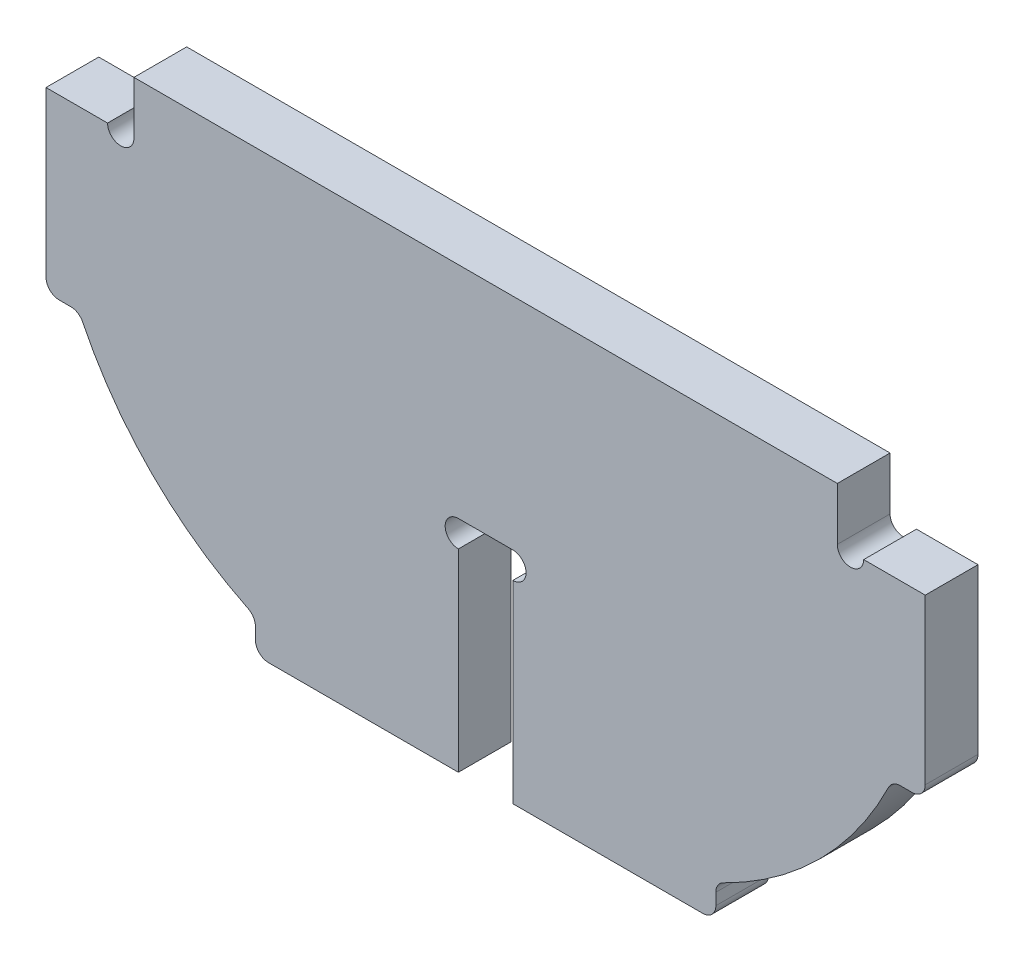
ISO-10303-21;
HEADER;
FILE_DESCRIPTION(('STEP AP214'),'2;1');
FILE_NAME('part.step','',(''),(''),'','','');
FILE_SCHEMA(('AUTOMOTIVE_DESIGN { 1 0 10303 214 1 1 1 1 }'));
ENDSEC;
DATA;
#1=APPLICATION_CONTEXT('core data for automotive mechanical design processes');
#2=APPLICATION_PROTOCOL_DEFINITION('international standard','automotive_design',2000,#1);
#3=PRODUCT_CONTEXT('',#1,'mechanical');
#4=PRODUCT('Part','Part','',(#3));
#5=PRODUCT_RELATED_PRODUCT_CATEGORY('part','',(#4));
#6=PRODUCT_DEFINITION_FORMATION('','',#4);
#7=PRODUCT_DEFINITION_CONTEXT('part definition',#1,'design');
#8=PRODUCT_DEFINITION('design','',#6,#7);
#9=PRODUCT_DEFINITION_SHAPE('','',#8);
#10=(LENGTH_UNIT() NAMED_UNIT(*) SI_UNIT(.MILLI.,.METRE.));
#11=(NAMED_UNIT(*) PLANE_ANGLE_UNIT() SI_UNIT($,.RADIAN.));
#12=(NAMED_UNIT(*) SI_UNIT($,.STERADIAN.) SOLID_ANGLE_UNIT());
#13=UNCERTAINTY_MEASURE_WITH_UNIT(LENGTH_MEASURE(1.E-05),#10,'distance_accuracy_value','');
#14=(GEOMETRIC_REPRESENTATION_CONTEXT(3) GLOBAL_UNCERTAINTY_ASSIGNED_CONTEXT((#13)) GLOBAL_UNIT_ASSIGNED_CONTEXT((#10,
#11,#12)) REPRESENTATION_CONTEXT('',''));
#15=CARTESIAN_POINT('',(0.,0.,0.));
#16=DIRECTION('',(0.,0.,1.));
#17=DIRECTION('',(1.,0.,0.));
#18=AXIS2_PLACEMENT_3D('',#15,#16,#17);
#19=CARTESIAN_POINT('',(-100.,-50.,12.));
#20=DIRECTION('',(0.,1.,0.));
#21=DIRECTION('',(0.,0.,1.));
#22=AXIS2_PLACEMENT_3D('',#19,#20,#21);
#23=PLANE('',#22);
#24=DIRECTION('',(0.,0.,-1.));
#25=VECTOR('',#24,1.);
#26=CARTESIAN_POINT('',(-49.3687742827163,-50.,12.));
#27=LINE('',#26,#25);
#28=CARTESIAN_POINT('',(-49.3687742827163,-50.,12.));
#29=VERTEX_POINT('',#28);
#30=CARTESIAN_POINT('',(-49.3687742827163,-50.,0.));
#31=VERTEX_POINT('',#30);
#32=EDGE_CURVE('E291',#29,#31,#27,.T.);
#33=ORIENTED_EDGE('',*,*,#32,.T.);
#34=DIRECTION('',(1.,0.,0.));
#35=VECTOR('',#34,1.);
#36=CARTESIAN_POINT('',(-100.,-50.,0.));
#37=LINE('',#36,#35);
#38=CARTESIAN_POINT('',(-6.19999999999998,-50.,0.));
#39=VERTEX_POINT('',#38);
#40=EDGE_CURVE('E393',#31,#39,#37,.T.);
#41=ORIENTED_EDGE('',*,*,#40,.T.);
#42=DIRECTION('',(0.,0.,-1.));
#43=VECTOR('',#42,1.);
#44=CARTESIAN_POINT('',(-6.19999999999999,-50.,12.));
#45=LINE('',#44,#43);
#46=CARTESIAN_POINT('',(-6.19999999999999,-50.,12.));
#47=VERTEX_POINT('',#46);
#48=EDGE_CURVE('E377',#47,#39,#45,.T.);
#49=ORIENTED_EDGE('',*,*,#48,.F.);
#50=DIRECTION('',(1.,0.,0.));
#51=VECTOR('',#50,1.);
#52=CARTESIAN_POINT('',(-100.,-50.,12.));
#53=LINE('',#52,#51);
#54=EDGE_CURVE('E411',#29,#47,#53,.T.);
#55=ORIENTED_EDGE('',*,*,#54,.F.);
#56=EDGE_LOOP('',(#33,#41,#49,#55));
#57=FACE_BOUND('',#56,.T.);
#58=ADVANCED_FACE('F35',(#57),#23,.F.);
#59=DIRECTION('',(0.,0.,-1.));
#60=VECTOR('',#59,1.);
#61=CARTESIAN_POINT('',(49.3687742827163,-50.,12.));
#62=LINE('',#61,#60);
#63=CARTESIAN_POINT('',(49.3687742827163,-50.,12.));
#64=VERTEX_POINT('',#63);
#65=CARTESIAN_POINT('',(49.3687742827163,-50.,0.));
#66=VERTEX_POINT('',#65);
#67=EDGE_CURVE('E339',#64,#66,#62,.T.);
#68=ORIENTED_EDGE('',*,*,#67,.F.);
#69=CARTESIAN_POINT('',(6.19999999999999,-50.,12.));
#70=VERTEX_POINT('',#69);
#71=EDGE_CURVE('E410',#70,#64,#53,.T.);
#72=ORIENTED_EDGE('',*,*,#71,.F.);
#73=DIRECTION('',(0.,0.,-1.));
#74=VECTOR('',#73,1.);
#75=CARTESIAN_POINT('',(6.19999999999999,-50.,12.));
#76=LINE('',#75,#74);
#77=CARTESIAN_POINT('',(6.19999999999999,-50.,0.));
#78=VERTEX_POINT('',#77);
#79=EDGE_CURVE('E361',#70,#78,#76,.T.);
#80=ORIENTED_EDGE('',*,*,#79,.T.);
#81=EDGE_CURVE('E432',#78,#66,#37,.T.);
#82=ORIENTED_EDGE('',*,*,#81,.T.);
#83=EDGE_LOOP('',(#68,#72,#80,#82));
#84=FACE_BOUND('',#83,.T.);
#85=ADVANCED_FACE('F515',(#84),#23,.F.);
#86=CARTESIAN_POINT('',(-83.,38.,12.));
#87=DIRECTION('',(0.,0.,1.));
#88=DIRECTION('',(1.,0.,0.));
#89=AXIS2_PLACEMENT_3D('',#86,#87,#88);
#90=PLANE('',#89);
#91=CARTESIAN_POINT('',(-97.,0.631225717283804,12.));
#92=DIRECTION('',(0.,0.,1.));
#93=DIRECTION('',(-1.,0.,0.));
#94=AXIS2_PLACEMENT_3D('',#91,#92,#93);
#95=CIRCLE('',#94,3.);
#96=CARTESIAN_POINT('',(-100.,0.631225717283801,12.));
#97=VERTEX_POINT('',#96);
#98=CARTESIAN_POINT('',(-97.,-2.3687742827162,12.));
#99=VERTEX_POINT('',#98);
#100=EDGE_CURVE('E50',#97,#99,#95,.T.);
#101=ORIENTED_EDGE('',*,*,#100,.T.);
#102=DIRECTION('',(1.,0.,0.));
#103=VECTOR('',#102,1.);
#104=CARTESIAN_POINT('',(-97.,-2.3687742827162,12.));
#105=LINE('',#104,#103);
#106=CARTESIAN_POINT('',(-94.345102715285,-2.36877428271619,12.));
#107=VERTEX_POINT('',#106);
#108=EDGE_CURVE('E257',#99,#107,#105,.T.);
#109=ORIENTED_EDGE('',*,*,#108,.T.);
#110=CARTESIAN_POINT('',(-94.345102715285,-5.3687742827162,12.));
#111=DIRECTION('',(0.,0.,-1.));
#112=DIRECTION('',(-1.,0.,0.));
#113=AXIS2_PLACEMENT_3D('',#110,#111,#112);
#114=CIRCLE('',#113,3.00000000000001);
#115=CARTESIAN_POINT('',(-91.6505696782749,-4.04987636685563,12.));
#116=VERTEX_POINT('',#115);
#117=EDGE_CURVE('E236',#107,#116,#114,.T.);
#118=ORIENTED_EDGE('',*,*,#117,.T.);
#119=CARTESIAN_POINT('',(-18.,32.,12.));
#120=DIRECTION('',(0.,0.,1.));
#121=DIRECTION('',(-1.,0.,0.));
#122=AXIS2_PLACEMENT_3D('',#119,#120,#121);
#123=CIRCLE('',#122,82.);
#124=CARTESIAN_POINT('',(-54.0498763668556,-41.6505696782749,12.));
#125=VERTEX_POINT('',#124);
#126=EDGE_CURVE('E247',#116,#125,#123,.T.);
#127=ORIENTED_EDGE('',*,*,#126,.T.);
#128=CARTESIAN_POINT('',(-55.3687742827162,-44.345102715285,12.));
#129=DIRECTION('',(0.,0.,-1.));
#130=DIRECTION('',(-1.,0.,0.));
#131=AXIS2_PLACEMENT_3D('',#128,#129,#130);
#132=CIRCLE('',#131,2.99999999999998);
#133=CARTESIAN_POINT('',(-52.3687742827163,-44.345102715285,12.));
#134=VERTEX_POINT('',#133);
#135=EDGE_CURVE('E268',#125,#134,#132,.T.);
#136=ORIENTED_EDGE('',*,*,#135,.T.);
#137=DIRECTION('',(0.,-1.,0.));
#138=VECTOR('',#137,1.);
#139=CARTESIAN_POINT('',(-52.3687742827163,-47.,12.));
#140=LINE('',#139,#138);
#141=CARTESIAN_POINT('',(-52.3687742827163,-47.,12.));
#142=VERTEX_POINT('',#141);
#143=EDGE_CURVE('E265',#134,#142,#140,.T.);
#144=ORIENTED_EDGE('',*,*,#143,.T.);
#145=CARTESIAN_POINT('',(-49.3687742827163,-47.,12.));
#146=DIRECTION('',(0.,0.,1.));
#147=DIRECTION('',(-1.,0.,0.));
#148=AXIS2_PLACEMENT_3D('',#145,#146,#147);
#149=CIRCLE('',#148,3.00000000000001);
#150=EDGE_CURVE('E262',#142,#29,#149,.T.);
#151=ORIENTED_EDGE('',*,*,#150,.T.);
#152=ORIENTED_EDGE('',*,*,#54,.T.);
#153=DIRECTION('',(0.,-1.,0.));
#154=VECTOR('',#153,1.);
#155=CARTESIAN_POINT('',(-6.19999999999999,-50.,12.));
#156=LINE('',#155,#154);
#157=CARTESIAN_POINT('',(-6.2,-6.00000000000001,12.));
#158=VERTEX_POINT('',#157);
#159=EDGE_CURVE('E358',#158,#47,#156,.T.);
#160=ORIENTED_EDGE('',*,*,#159,.F.);
#161=CARTESIAN_POINT('',(-6.2,-3.,12.));
#162=DIRECTION('',(0.,0.,1.));
#163=DIRECTION('',(1.,0.,0.));
#164=AXIS2_PLACEMENT_3D('',#161,#162,#163);
#165=CIRCLE('',#164,3.00000000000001);
#166=CARTESIAN_POINT('',(-6.2,0.,12.));
#167=VERTEX_POINT('',#166);
#168=EDGE_CURVE('E356',#167,#158,#165,.T.);
#169=ORIENTED_EDGE('',*,*,#168,.F.);
#170=DIRECTION('',(-1.,0.,0.));
#171=VECTOR('',#170,1.);
#172=CARTESIAN_POINT('',(6.2,0.,12.));
#173=LINE('',#172,#171);
#174=CARTESIAN_POINT('',(6.2,0.,12.));
#175=VERTEX_POINT('',#174);
#176=EDGE_CURVE('E354',#175,#167,#173,.T.);
#177=ORIENTED_EDGE('',*,*,#176,.F.);
#178=CARTESIAN_POINT('',(6.2,-3.,12.));
#179=DIRECTION('',(0.,0.,1.));
#180=DIRECTION('',(1.,0.,0.));
#181=AXIS2_PLACEMENT_3D('',#178,#179,#180);
#182=CIRCLE('',#181,3.);
#183=CARTESIAN_POINT('',(6.2,-6.00000000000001,12.));
#184=VERTEX_POINT('',#183);
#185=EDGE_CURVE('E351',#184,#175,#182,.T.);
#186=ORIENTED_EDGE('',*,*,#185,.F.);
#187=DIRECTION('',(0.,1.,0.));
#188=VECTOR('',#187,1.);
#189=CARTESIAN_POINT('',(6.19999999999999,-50.,12.));
#190=LINE('',#189,#188);
#191=EDGE_CURVE('E349',#70,#184,#190,.T.);
#192=ORIENTED_EDGE('',*,*,#191,.F.);
#193=ORIENTED_EDGE('',*,*,#71,.T.);
#194=CARTESIAN_POINT('',(49.3687742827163,-47.,12.));
#195=DIRECTION('',(0.,0.,-1.));
#196=DIRECTION('',(1.,0.,0.));
#197=AXIS2_PLACEMENT_3D('',#194,#195,#196);
#198=CIRCLE('',#197,3.00000000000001);
#199=CARTESIAN_POINT('',(52.3687742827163,-47.,12.));
#200=VERTEX_POINT('',#199);
#201=EDGE_CURVE('E306',#200,#64,#198,.T.);
#202=ORIENTED_EDGE('',*,*,#201,.F.);
#203=DIRECTION('',(0.,-1.,0.));
#204=VECTOR('',#203,1.);
#205=CARTESIAN_POINT('',(52.3687742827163,-47.,12.));
#206=LINE('',#205,#204);
#207=CARTESIAN_POINT('',(52.3687742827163,-44.345102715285,12.));
#208=VERTEX_POINT('',#207);
#209=EDGE_CURVE('E304',#208,#200,#206,.T.);
#210=ORIENTED_EDGE('',*,*,#209,.F.);
#211=CARTESIAN_POINT('',(55.3687742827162,-44.345102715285,12.));
#212=DIRECTION('',(0.,0.,1.));
#213=DIRECTION('',(1.,0.,0.));
#214=AXIS2_PLACEMENT_3D('',#211,#212,#213);
#215=CIRCLE('',#214,2.99999999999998);
#216=CARTESIAN_POINT('',(54.0498763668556,-41.6505696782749,12.));
#217=VERTEX_POINT('',#216);
#218=EDGE_CURVE('E301',#217,#208,#215,.T.);
#219=ORIENTED_EDGE('',*,*,#218,.F.);
#220=CARTESIAN_POINT('',(18.,32.,12.));
#221=DIRECTION('',(0.,0.,-1.));
#222=DIRECTION('',(1.,0.,0.));
#223=AXIS2_PLACEMENT_3D('',#220,#221,#222);
#224=CIRCLE('',#223,82.);
#225=CARTESIAN_POINT('',(91.6505696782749,-4.04987636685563,12.));
#226=VERTEX_POINT('',#225);
#227=EDGE_CURVE('E299',#226,#217,#224,.T.);
#228=ORIENTED_EDGE('',*,*,#227,.F.);
#229=CARTESIAN_POINT('',(94.345102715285,-5.3687742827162,12.));
#230=DIRECTION('',(0.,0.,1.));
#231=DIRECTION('',(1.,0.,0.));
#232=AXIS2_PLACEMENT_3D('',#229,#230,#231);
#233=CIRCLE('',#232,3.00000000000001);
#234=CARTESIAN_POINT('',(94.345102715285,-2.36877428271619,12.));
#235=VERTEX_POINT('',#234);
#236=EDGE_CURVE('E312',#235,#226,#233,.T.);
#237=ORIENTED_EDGE('',*,*,#236,.F.);
#238=DIRECTION('',(-1.,0.,0.));
#239=VECTOR('',#238,1.);
#240=CARTESIAN_POINT('',(97.,-2.3687742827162,12.));
#241=LINE('',#240,#239);
#242=CARTESIAN_POINT('',(97.,-2.3687742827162,12.));
#243=VERTEX_POINT('',#242);
#244=EDGE_CURVE('E310',#243,#235,#241,.T.);
#245=ORIENTED_EDGE('',*,*,#244,.F.);
#246=CARTESIAN_POINT('',(97.,0.631225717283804,12.));
#247=DIRECTION('',(0.,0.,-1.));
#248=DIRECTION('',(1.,0.,0.));
#249=AXIS2_PLACEMENT_3D('',#246,#247,#248);
#250=CIRCLE('',#249,3.);
#251=CARTESIAN_POINT('',(100.,0.631225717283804,12.));
#252=VERTEX_POINT('',#251);
#253=EDGE_CURVE('E308',#252,#243,#250,.T.);
#254=ORIENTED_EDGE('',*,*,#253,.F.);
#255=DIRECTION('',(0.,1.,0.));
#256=VECTOR('',#255,1.);
#257=CARTESIAN_POINT('',(100.,38.,12.));
#258=LINE('',#257,#256);
#259=CARTESIAN_POINT('',(100.,38.,12.));
#260=VERTEX_POINT('',#259);
#261=EDGE_CURVE('E390',#252,#260,#258,.T.);
#262=ORIENTED_EDGE('',*,*,#261,.T.);
#263=DIRECTION('',(-1.,0.,0.));
#264=VECTOR('',#263,1.);
#265=CARTESIAN_POINT('',(86.,38.,12.));
#266=LINE('',#265,#264);
#267=CARTESIAN_POINT('',(86.,38.,12.));
#268=VERTEX_POINT('',#267);
#269=EDGE_CURVE('E392',#260,#268,#266,.T.);
#270=ORIENTED_EDGE('',*,*,#269,.T.);
#271=CARTESIAN_POINT('',(83.,38.,12.));
#272=DIRECTION('',(0.,0.,-1.));
#273=DIRECTION('',(1.,0.,0.));
#274=AXIS2_PLACEMENT_3D('',#271,#272,#273);
#275=CIRCLE('',#274,3.);
#276=CARTESIAN_POINT('',(80.,38.,12.));
#277=VERTEX_POINT('',#276);
#278=EDGE_CURVE('E395',#268,#277,#275,.T.);
#279=ORIENTED_EDGE('',*,*,#278,.T.);
#280=DIRECTION('',(0.,1.,0.));
#281=VECTOR('',#280,1.);
#282=CARTESIAN_POINT('',(80.,50.,12.));
#283=LINE('',#282,#281);
#284=CARTESIAN_POINT('',(80.,50.,12.));
#285=VERTEX_POINT('',#284);
#286=EDGE_CURVE('E397',#277,#285,#283,.T.);
#287=ORIENTED_EDGE('',*,*,#286,.T.);
#288=DIRECTION('',(-1.,0.,0.));
#289=VECTOR('',#288,1.);
#290=CARTESIAN_POINT('',(-80.,50.,12.));
#291=LINE('',#290,#289);
#292=CARTESIAN_POINT('',(-80.,50.,12.));
#293=VERTEX_POINT('',#292);
#294=EDGE_CURVE('E399',#285,#293,#291,.T.);
#295=ORIENTED_EDGE('',*,*,#294,.T.);
#296=DIRECTION('',(0.,-1.,0.));
#297=VECTOR('',#296,1.);
#298=CARTESIAN_POINT('',(-80.,38.,12.));
#299=LINE('',#298,#297);
#300=CARTESIAN_POINT('',(-80.,38.,12.));
#301=VERTEX_POINT('',#300);
#302=EDGE_CURVE('E401',#293,#301,#299,.T.);
#303=ORIENTED_EDGE('',*,*,#302,.T.);
#304=CARTESIAN_POINT('',(-83.,38.,12.));
#305=DIRECTION('',(0.,0.,-1.));
#306=DIRECTION('',(1.,0.,0.));
#307=AXIS2_PLACEMENT_3D('',#304,#305,#306);
#308=CIRCLE('',#307,3.);
#309=CARTESIAN_POINT('',(-86.,38.,12.));
#310=VERTEX_POINT('',#309);
#311=EDGE_CURVE('E403',#301,#310,#308,.T.);
#312=ORIENTED_EDGE('',*,*,#311,.T.);
#313=DIRECTION('',(-1.,0.,0.));
#314=VECTOR('',#313,1.);
#315=CARTESIAN_POINT('',(-100.,38.,12.));
#316=LINE('',#315,#314);
#317=CARTESIAN_POINT('',(-100.,38.,12.));
#318=VERTEX_POINT('',#317);
#319=EDGE_CURVE('E405',#310,#318,#316,.T.);
#320=ORIENTED_EDGE('',*,*,#319,.T.);
#321=DIRECTION('',(0.,-1.,0.));
#322=VECTOR('',#321,1.);
#323=CARTESIAN_POINT('',(-100.,38.,12.));
#324=LINE('',#323,#322);
#325=EDGE_CURVE('E407',#318,#97,#324,.T.);
#326=ORIENTED_EDGE('',*,*,#325,.T.);
#327=EDGE_LOOP('',(#101,#109,#118,#127,#136,#144,#151,#152,#160,#169,#177,#186,#192,#193,#202,
#210,#219,#228,#237,#245,#254,#262,#270,#279,#287,#295,#303,#312,#320,#326));
#328=FACE_BOUND('',#327,.T.);
#329=ADVANCED_FACE('F255',(#328),#90,.T.);
#330=CARTESIAN_POINT('',(-83.,38.,0.));
#331=DIRECTION('',(0.,0.,1.));
#332=DIRECTION('',(1.,0.,0.));
#333=AXIS2_PLACEMENT_3D('',#330,#331,#332);
#334=PLANE('',#333);
#335=DIRECTION('',(1.,0.,0.));
#336=VECTOR('',#335,1.);
#337=CARTESIAN_POINT('',(-97.,-2.3687742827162,0.));
#338=LINE('',#337,#336);
#339=CARTESIAN_POINT('',(-97.,-2.3687742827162,0.));
#340=VERTEX_POINT('',#339);
#341=CARTESIAN_POINT('',(-94.345102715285,-2.36877428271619,0.));
#342=VERTEX_POINT('',#341);
#343=EDGE_CURVE('E273',#340,#342,#338,.T.);
#344=ORIENTED_EDGE('',*,*,#343,.F.);
#345=CARTESIAN_POINT('',(-97.,0.631225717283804,0.));
#346=DIRECTION('',(0.,0.,1.));
#347=DIRECTION('',(-1.,0.,0.));
#348=AXIS2_PLACEMENT_3D('',#345,#346,#347);
#349=CIRCLE('',#348,3.);
#350=CARTESIAN_POINT('',(-100.,0.631225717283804,0.));
#351=VERTEX_POINT('',#350);
#352=EDGE_CURVE('E276',#351,#340,#349,.T.);
#353=ORIENTED_EDGE('',*,*,#352,.F.);
#354=DIRECTION('',(0.,-1.,0.));
#355=VECTOR('',#354,1.);
#356=CARTESIAN_POINT('',(-100.,38.,0.));
#357=LINE('',#356,#355);
#358=CARTESIAN_POINT('',(-100.,38.,0.));
#359=VERTEX_POINT('',#358);
#360=EDGE_CURVE('E429',#359,#351,#357,.T.);
#361=ORIENTED_EDGE('',*,*,#360,.F.);
#362=DIRECTION('',(-1.,0.,0.));
#363=VECTOR('',#362,1.);
#364=CARTESIAN_POINT('',(-100.,38.,0.));
#365=LINE('',#364,#363);
#366=CARTESIAN_POINT('',(-86.,38.,0.));
#367=VERTEX_POINT('',#366);
#368=EDGE_CURVE('E427',#367,#359,#365,.T.);
#369=ORIENTED_EDGE('',*,*,#368,.F.);
#370=CARTESIAN_POINT('',(-83.,38.,0.));
#371=DIRECTION('',(0.,0.,-1.));
#372=DIRECTION('',(1.,0.,0.));
#373=AXIS2_PLACEMENT_3D('',#370,#371,#372);
#374=CIRCLE('',#373,3.);
#375=CARTESIAN_POINT('',(-80.,38.,0.));
#376=VERTEX_POINT('',#375);
#377=EDGE_CURVE('E425',#376,#367,#374,.T.);
#378=ORIENTED_EDGE('',*,*,#377,.F.);
#379=DIRECTION('',(0.,-1.,0.));
#380=VECTOR('',#379,1.);
#381=CARTESIAN_POINT('',(-80.,38.,0.));
#382=LINE('',#381,#380);
#383=CARTESIAN_POINT('',(-80.,50.,0.));
#384=VERTEX_POINT('',#383);
#385=EDGE_CURVE('E423',#384,#376,#382,.T.);
#386=ORIENTED_EDGE('',*,*,#385,.F.);
#387=DIRECTION('',(-1.,0.,0.));
#388=VECTOR('',#387,1.);
#389=CARTESIAN_POINT('',(-80.,50.,0.));
#390=LINE('',#389,#388);
#391=CARTESIAN_POINT('',(80.,50.,0.));
#392=VERTEX_POINT('',#391);
#393=EDGE_CURVE('E421',#392,#384,#390,.T.);
#394=ORIENTED_EDGE('',*,*,#393,.F.);
#395=DIRECTION('',(0.,1.,0.));
#396=VECTOR('',#395,1.);
#397=CARTESIAN_POINT('',(80.,50.,0.));
#398=LINE('',#397,#396);
#399=CARTESIAN_POINT('',(80.,38.,0.));
#400=VERTEX_POINT('',#399);
#401=EDGE_CURVE('E419',#400,#392,#398,.T.);
#402=ORIENTED_EDGE('',*,*,#401,.F.);
#403=CARTESIAN_POINT('',(83.,38.,0.));
#404=DIRECTION('',(0.,0.,-1.));
#405=DIRECTION('',(1.,0.,0.));
#406=AXIS2_PLACEMENT_3D('',#403,#404,#405);
#407=CIRCLE('',#406,3.);
#408=CARTESIAN_POINT('',(86.,38.,0.));
#409=VERTEX_POINT('',#408);
#410=EDGE_CURVE('E417',#409,#400,#407,.T.);
#411=ORIENTED_EDGE('',*,*,#410,.F.);
#412=DIRECTION('',(-1.,0.,0.));
#413=VECTOR('',#412,1.);
#414=CARTESIAN_POINT('',(86.,38.,0.));
#415=LINE('',#414,#413);
#416=CARTESIAN_POINT('',(100.,38.,0.));
#417=VERTEX_POINT('',#416);
#418=EDGE_CURVE('E415',#417,#409,#415,.T.);
#419=ORIENTED_EDGE('',*,*,#418,.F.);
#420=DIRECTION('',(0.,1.,0.));
#421=VECTOR('',#420,1.);
#422=CARTESIAN_POINT('',(100.,38.,0.));
#423=LINE('',#422,#421);
#424=CARTESIAN_POINT('',(100.,0.631225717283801,0.));
#425=VERTEX_POINT('',#424);
#426=EDGE_CURVE('E389',#425,#417,#423,.T.);
#427=ORIENTED_EDGE('',*,*,#426,.F.);
#428=CARTESIAN_POINT('',(97.,0.631225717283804,0.));
#429=DIRECTION('',(0.,0.,-1.));
#430=DIRECTION('',(1.,0.,0.));
#431=AXIS2_PLACEMENT_3D('',#428,#429,#430);
#432=CIRCLE('',#431,3.);
#433=CARTESIAN_POINT('',(97.,-2.3687742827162,0.));
#434=VERTEX_POINT('',#433);
#435=EDGE_CURVE('E58',#425,#434,#432,.T.);
#436=ORIENTED_EDGE('',*,*,#435,.T.);
#437=DIRECTION('',(-1.,0.,0.));
#438=VECTOR('',#437,1.);
#439=CARTESIAN_POINT('',(97.,-2.3687742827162,0.));
#440=LINE('',#439,#438);
#441=CARTESIAN_POINT('',(94.345102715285,-2.36877428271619,0.));
#442=VERTEX_POINT('',#441);
#443=EDGE_CURVE('E327',#434,#442,#440,.T.);
#444=ORIENTED_EDGE('',*,*,#443,.T.);
#445=CARTESIAN_POINT('',(94.345102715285,-5.3687742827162,0.));
#446=DIRECTION('',(0.,0.,1.));
#447=DIRECTION('',(1.,0.,0.));
#448=AXIS2_PLACEMENT_3D('',#445,#446,#447);
#449=CIRCLE('',#448,3.00000000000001);
#450=CARTESIAN_POINT('',(91.6505696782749,-4.04987636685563,0.));
#451=VERTEX_POINT('',#450);
#452=EDGE_CURVE('E302',#442,#451,#449,.T.);
#453=ORIENTED_EDGE('',*,*,#452,.T.);
#454=CARTESIAN_POINT('',(18.,32.,0.));
#455=DIRECTION('',(0.,0.,-1.));
#456=DIRECTION('',(1.,0.,0.));
#457=AXIS2_PLACEMENT_3D('',#454,#455,#456);
#458=CIRCLE('',#457,82.);
#459=CARTESIAN_POINT('',(54.0498763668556,-41.6505696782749,0.));
#460=VERTEX_POINT('',#459);
#461=EDGE_CURVE('E243',#451,#460,#458,.T.);
#462=ORIENTED_EDGE('',*,*,#461,.T.);
#463=CARTESIAN_POINT('',(55.3687742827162,-44.345102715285,0.));
#464=DIRECTION('',(0.,0.,1.));
#465=DIRECTION('',(1.,0.,0.));
#466=AXIS2_PLACEMENT_3D('',#463,#464,#465);
#467=CIRCLE('',#466,2.99999999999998);
#468=CARTESIAN_POINT('',(52.3687742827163,-44.345102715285,0.));
#469=VERTEX_POINT('',#468);
#470=EDGE_CURVE('E317',#460,#469,#467,.T.);
#471=ORIENTED_EDGE('',*,*,#470,.T.);
#472=DIRECTION('',(0.,-1.,0.));
#473=VECTOR('',#472,1.);
#474=CARTESIAN_POINT('',(52.3687742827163,-47.,0.));
#475=LINE('',#474,#473);
#476=CARTESIAN_POINT('',(52.3687742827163,-47.,0.));
#477=VERTEX_POINT('',#476);
#478=EDGE_CURVE('E320',#469,#477,#475,.T.);
#479=ORIENTED_EDGE('',*,*,#478,.T.);
#480=CARTESIAN_POINT('',(49.3687742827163,-47.,0.));
#481=DIRECTION('',(0.,0.,-1.));
#482=DIRECTION('',(1.,0.,0.));
#483=AXIS2_PLACEMENT_3D('',#480,#481,#482);
#484=CIRCLE('',#483,3.00000000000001);
#485=EDGE_CURVE('E323',#477,#66,#484,.T.);
#486=ORIENTED_EDGE('',*,*,#485,.T.);
#487=ORIENTED_EDGE('',*,*,#81,.F.);
#488=DIRECTION('',(0.,1.,0.));
#489=VECTOR('',#488,1.);
#490=CARTESIAN_POINT('',(6.19999999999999,-50.,0.));
#491=LINE('',#490,#489);
#492=CARTESIAN_POINT('',(6.2,-6.00000000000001,0.));
#493=VERTEX_POINT('',#492);
#494=EDGE_CURVE('E348',#78,#493,#491,.T.);
#495=ORIENTED_EDGE('',*,*,#494,.T.);
#496=CARTESIAN_POINT('',(6.2,-3.,0.));
#497=DIRECTION('',(0.,0.,1.));
#498=DIRECTION('',(1.,0.,0.));
#499=AXIS2_PLACEMENT_3D('',#496,#497,#498);
#500=CIRCLE('',#499,3.);
#501=CARTESIAN_POINT('',(6.2,0.,0.));
#502=VERTEX_POINT('',#501);
#503=EDGE_CURVE('E364',#493,#502,#500,.T.);
#504=ORIENTED_EDGE('',*,*,#503,.T.);
#505=DIRECTION('',(-1.,0.,0.));
#506=VECTOR('',#505,1.);
#507=CARTESIAN_POINT('',(6.2,0.,0.));
#508=LINE('',#507,#506);
#509=CARTESIAN_POINT('',(-6.2,0.,0.));
#510=VERTEX_POINT('',#509);
#511=EDGE_CURVE('E367',#502,#510,#508,.T.);
#512=ORIENTED_EDGE('',*,*,#511,.T.);
#513=CARTESIAN_POINT('',(-6.2,-3.,0.));
#514=DIRECTION('',(0.,0.,1.));
#515=DIRECTION('',(1.,0.,0.));
#516=AXIS2_PLACEMENT_3D('',#513,#514,#515);
#517=CIRCLE('',#516,3.00000000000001);
#518=CARTESIAN_POINT('',(-6.2,-6.00000000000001,0.));
#519=VERTEX_POINT('',#518);
#520=EDGE_CURVE('E370',#510,#519,#517,.T.);
#521=ORIENTED_EDGE('',*,*,#520,.T.);
#522=DIRECTION('',(0.,-1.,0.));
#523=VECTOR('',#522,1.);
#524=CARTESIAN_POINT('',(-6.19999999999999,-50.,0.));
#525=LINE('',#524,#523);
#526=EDGE_CURVE('E352',#519,#39,#525,.T.);
#527=ORIENTED_EDGE('',*,*,#526,.T.);
#528=ORIENTED_EDGE('',*,*,#40,.F.);
#529=CARTESIAN_POINT('',(-49.3687742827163,-47.,0.));
#530=DIRECTION('',(0.,0.,1.));
#531=DIRECTION('',(-1.,0.,0.));
#532=AXIS2_PLACEMENT_3D('',#529,#530,#531);
#533=CIRCLE('',#532,3.00000000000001);
#534=CARTESIAN_POINT('',(-52.3687742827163,-47.,0.));
#535=VERTEX_POINT('',#534);
#536=EDGE_CURVE('E279',#535,#31,#533,.T.);
#537=ORIENTED_EDGE('',*,*,#536,.F.);
#538=DIRECTION('',(0.,-1.,0.));
#539=VECTOR('',#538,1.);
#540=CARTESIAN_POINT('',(-52.3687742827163,-47.,0.));
#541=LINE('',#540,#539);
#542=CARTESIAN_POINT('',(-52.3687742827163,-44.345102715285,0.));
#543=VERTEX_POINT('',#542);
#544=EDGE_CURVE('E281',#543,#535,#541,.T.);
#545=ORIENTED_EDGE('',*,*,#544,.F.);
#546=CARTESIAN_POINT('',(-55.3687742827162,-44.345102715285,0.));
#547=DIRECTION('',(0.,0.,-1.));
#548=DIRECTION('',(-1.,0.,0.));
#549=AXIS2_PLACEMENT_3D('',#546,#547,#548);
#550=CIRCLE('',#549,2.99999999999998);
#551=CARTESIAN_POINT('',(-54.0498763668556,-41.6505696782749,0.));
#552=VERTEX_POINT('',#551);
#553=EDGE_CURVE('E253',#552,#543,#550,.T.);
#554=ORIENTED_EDGE('',*,*,#553,.F.);
#555=CARTESIAN_POINT('',(-18.,32.,0.));
#556=DIRECTION('',(0.,0.,1.));
#557=DIRECTION('',(-1.,0.,0.));
#558=AXIS2_PLACEMENT_3D('',#555,#556,#557);
#559=CIRCLE('',#558,82.);
#560=CARTESIAN_POINT('',(-91.6505696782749,-4.04987636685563,0.));
#561=VERTEX_POINT('',#560);
#562=EDGE_CURVE('E270',#561,#552,#559,.T.);
#563=ORIENTED_EDGE('',*,*,#562,.F.);
#564=CARTESIAN_POINT('',(-94.345102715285,-5.3687742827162,0.));
#565=DIRECTION('',(0.,0.,-1.));
#566=DIRECTION('',(-1.,0.,0.));
#567=AXIS2_PLACEMENT_3D('',#564,#565,#566);
#568=CIRCLE('',#567,3.00000000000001);
#569=EDGE_CURVE('E239',#342,#561,#568,.T.);
#570=ORIENTED_EDGE('',*,*,#569,.F.);
#571=EDGE_LOOP('',(#344,#353,#361,#369,#378,#386,#394,#402,#411,#419,#427,#436,#444,#453,#462,
#471,#479,#486,#487,#495,#504,#512,#521,#527,#528,#537,#545,#554,#563,#570));
#572=FACE_BOUND('',#571,.T.);
#573=ADVANCED_FACE('F463',(#572),#334,.F.);
#574=CARTESIAN_POINT('',(100.,38.,12.));
#575=DIRECTION('',(-1.,0.,0.));
#576=DIRECTION('',(0.,-1.,0.));
#577=AXIS2_PLACEMENT_3D('',#574,#575,#576);
#578=PLANE('',#577);
#579=ORIENTED_EDGE('',*,*,#261,.F.);
#580=DIRECTION('',(0.,0.,-1.));
#581=VECTOR('',#580,1.);
#582=CARTESIAN_POINT('',(100.,0.631225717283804,12.));
#583=LINE('',#582,#581);
#584=EDGE_CURVE('E337',#252,#425,#583,.T.);
#585=ORIENTED_EDGE('',*,*,#584,.T.);
#586=ORIENTED_EDGE('',*,*,#426,.T.);
#587=DIRECTION('',(0.,0.,-1.));
#588=VECTOR('',#587,1.);
#589=CARTESIAN_POINT('',(100.,38.,12.));
#590=LINE('',#589,#588);
#591=EDGE_CURVE('E11',#260,#417,#590,.T.);
#592=ORIENTED_EDGE('',*,*,#591,.F.);
#593=EDGE_LOOP('',(#579,#585,#586,#592));
#594=FACE_BOUND('',#593,.T.);
#595=ADVANCED_FACE('F37',(#594),#578,.F.);
#596=CARTESIAN_POINT('',(86.,38.,12.));
#597=DIRECTION('',(0.,-1.,0.));
#598=DIRECTION('',(0.,0.,-1.));
#599=AXIS2_PLACEMENT_3D('',#596,#597,#598);
#600=PLANE('',#599);
#601=ORIENTED_EDGE('',*,*,#418,.T.);
#602=DIRECTION('',(0.,0.,-1.));
#603=VECTOR('',#602,1.);
#604=CARTESIAN_POINT('',(86.,38.,12.));
#605=LINE('',#604,#603);
#606=EDGE_CURVE('E43',#268,#409,#605,.T.);
#607=ORIENTED_EDGE('',*,*,#606,.F.);
#608=ORIENTED_EDGE('',*,*,#269,.F.);
#609=ORIENTED_EDGE('',*,*,#591,.T.);
#610=EDGE_LOOP('',(#601,#607,#608,#609));
#611=FACE_BOUND('',#610,.T.);
#612=ADVANCED_FACE('F480',(#611),#600,.F.);
#613=CARTESIAN_POINT('',(83.,38.,12.));
#614=DIRECTION('',(0.,0.,-1.));
#615=DIRECTION('',(-1.,0.,0.));
#616=AXIS2_PLACEMENT_3D('',#613,#614,#615);
#617=CYLINDRICAL_SURFACE('',#616,3.);
#618=ORIENTED_EDGE('',*,*,#410,.T.);
#619=DIRECTION('',(0.,0.,-1.));
#620=VECTOR('',#619,1.);
#621=CARTESIAN_POINT('',(80.,38.,12.));
#622=LINE('',#621,#620);
#623=EDGE_CURVE('E448',#277,#400,#622,.T.);
#624=ORIENTED_EDGE('',*,*,#623,.F.);
#625=ORIENTED_EDGE('',*,*,#278,.F.);
#626=ORIENTED_EDGE('',*,*,#606,.T.);
#627=EDGE_LOOP('',(#618,#624,#625,#626));
#628=FACE_BOUND('',#627,.T.);
#629=ADVANCED_FACE('F455',(#628),#617,.F.);
#630=CARTESIAN_POINT('',(80.,50.,12.));
#631=DIRECTION('',(-1.,0.,0.));
#632=DIRECTION('',(0.,0.,1.));
#633=AXIS2_PLACEMENT_3D('',#630,#631,#632);
#634=PLANE('',#633);
#635=ORIENTED_EDGE('',*,*,#401,.T.);
#636=DIRECTION('',(0.,0.,-1.));
#637=VECTOR('',#636,1.);
#638=CARTESIAN_POINT('',(80.,50.,12.));
#639=LINE('',#638,#637);
#640=EDGE_CURVE('E445',#285,#392,#639,.T.);
#641=ORIENTED_EDGE('',*,*,#640,.F.);
#642=ORIENTED_EDGE('',*,*,#286,.F.);
#643=ORIENTED_EDGE('',*,*,#623,.T.);
#644=EDGE_LOOP('',(#635,#641,#642,#643));
#645=FACE_BOUND('',#644,.T.);
#646=ADVANCED_FACE('F469',(#645),#634,.F.);
#647=CARTESIAN_POINT('',(-80.,50.,12.));
#648=DIRECTION('',(0.,-1.,0.));
#649=DIRECTION('',(0.,0.,-1.));
#650=AXIS2_PLACEMENT_3D('',#647,#648,#649);
#651=PLANE('',#650);
#652=ORIENTED_EDGE('',*,*,#393,.T.);
#653=DIRECTION('',(0.,0.,-1.));
#654=VECTOR('',#653,1.);
#655=CARTESIAN_POINT('',(-80.,50.,12.));
#656=LINE('',#655,#654);
#657=EDGE_CURVE('E442',#293,#384,#656,.T.);
#658=ORIENTED_EDGE('',*,*,#657,.F.);
#659=ORIENTED_EDGE('',*,*,#294,.F.);
#660=ORIENTED_EDGE('',*,*,#640,.T.);
#661=EDGE_LOOP('',(#652,#658,#659,#660));
#662=FACE_BOUND('',#661,.T.);
#663=ADVANCED_FACE('F473',(#662),#651,.F.);
#664=CARTESIAN_POINT('',(-80.,38.,12.));
#665=DIRECTION('',(1.,0.,0.));
#666=DIRECTION('',(0.,0.,-1.));
#667=AXIS2_PLACEMENT_3D('',#664,#665,#666);
#668=PLANE('',#667);
#669=ORIENTED_EDGE('',*,*,#385,.T.);
#670=DIRECTION('',(0.,0.,-1.));
#671=VECTOR('',#670,1.);
#672=CARTESIAN_POINT('',(-80.,38.,12.));
#673=LINE('',#672,#671);
#674=EDGE_CURVE('E439',#301,#376,#673,.T.);
#675=ORIENTED_EDGE('',*,*,#674,.F.);
#676=ORIENTED_EDGE('',*,*,#302,.F.);
#677=ORIENTED_EDGE('',*,*,#657,.T.);
#678=EDGE_LOOP('',(#669,#675,#676,#677));
#679=FACE_BOUND('',#678,.T.);
#680=ADVANCED_FACE('F574',(#679),#668,.F.);
#681=CARTESIAN_POINT('',(-83.,38.,12.));
#682=DIRECTION('',(0.,0.,-1.));
#683=DIRECTION('',(-1.,0.,0.));
#684=AXIS2_PLACEMENT_3D('',#681,#682,#683);
#685=CYLINDRICAL_SURFACE('',#684,3.);
#686=ORIENTED_EDGE('',*,*,#377,.T.);
#687=DIRECTION('',(0.,0.,-1.));
#688=VECTOR('',#687,1.);
#689=CARTESIAN_POINT('',(-86.,38.,12.));
#690=LINE('',#689,#688);
#691=EDGE_CURVE('E436',#310,#367,#690,.T.);
#692=ORIENTED_EDGE('',*,*,#691,.F.);
#693=ORIENTED_EDGE('',*,*,#311,.F.);
#694=ORIENTED_EDGE('',*,*,#674,.T.);
#695=EDGE_LOOP('',(#686,#692,#693,#694));
#696=FACE_BOUND('',#695,.T.);
#697=ADVANCED_FACE('F572',(#696),#685,.F.);
#698=CARTESIAN_POINT('',(-100.,38.,12.));
#699=DIRECTION('',(0.,-1.,0.));
#700=DIRECTION('',(0.,0.,-1.));
#701=AXIS2_PLACEMENT_3D('',#698,#699,#700);
#702=PLANE('',#701);
#703=ORIENTED_EDGE('',*,*,#368,.T.);
#704=DIRECTION('',(0.,0.,-1.));
#705=VECTOR('',#704,1.);
#706=CARTESIAN_POINT('',(-100.,38.,12.));
#707=LINE('',#706,#705);
#708=EDGE_CURVE('E413',#318,#359,#707,.T.);
#709=ORIENTED_EDGE('',*,*,#708,.F.);
#710=ORIENTED_EDGE('',*,*,#319,.F.);
#711=ORIENTED_EDGE('',*,*,#691,.T.);
#712=EDGE_LOOP('',(#703,#709,#710,#711));
#713=FACE_BOUND('',#712,.T.);
#714=ADVANCED_FACE('F568',(#713),#702,.F.);
#715=CARTESIAN_POINT('',(-100.,38.,12.));
#716=DIRECTION('',(1.,0.,0.));
#717=DIRECTION('',(0.,1.,0.));
#718=AXIS2_PLACEMENT_3D('',#715,#716,#717);
#719=PLANE('',#718);
#720=ORIENTED_EDGE('',*,*,#360,.T.);
#721=DIRECTION('',(0.,0.,-1.));
#722=VECTOR('',#721,1.);
#723=CARTESIAN_POINT('',(-100.,0.631225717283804,12.));
#724=LINE('',#723,#722);
#725=EDGE_CURVE('E294',#97,#351,#724,.T.);
#726=ORIENTED_EDGE('',*,*,#725,.F.);
#727=ORIENTED_EDGE('',*,*,#325,.F.);
#728=ORIENTED_EDGE('',*,*,#708,.T.);
#729=EDGE_LOOP('',(#720,#726,#727,#728));
#730=FACE_BOUND('',#729,.T.);
#731=ADVANCED_FACE('F562',(#730),#719,.F.);
#732=CARTESIAN_POINT('',(6.19999999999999,-50.,12.));
#733=DIRECTION('',(-1.,0.,0.));
#734=DIRECTION('',(0.,-1.,0.));
#735=AXIS2_PLACEMENT_3D('',#732,#733,#734);
#736=PLANE('',#735);
#737=ORIENTED_EDGE('',*,*,#494,.F.);
#738=ORIENTED_EDGE('',*,*,#79,.F.);
#739=ORIENTED_EDGE('',*,*,#191,.T.);
#740=DIRECTION('',(0.,0.,-1.));
#741=VECTOR('',#740,1.);
#742=CARTESIAN_POINT('',(6.2,-6.00000000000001,12.));
#743=LINE('',#742,#741);
#744=EDGE_CURVE('E386',#184,#493,#743,.T.);
#745=ORIENTED_EDGE('',*,*,#744,.T.);
#746=EDGE_LOOP('',(#737,#738,#739,#745));
#747=FACE_BOUND('',#746,.T.);
#748=ADVANCED_FACE('F520',(#747),#736,.T.);
#749=CARTESIAN_POINT('',(6.2,-3.,12.));
#750=DIRECTION('',(0.,0.,-1.));
#751=DIRECTION('',(-1.,0.,0.));
#752=AXIS2_PLACEMENT_3D('',#749,#750,#751);
#753=CYLINDRICAL_SURFACE('',#752,3.);
#754=ORIENTED_EDGE('',*,*,#503,.F.);
#755=ORIENTED_EDGE('',*,*,#744,.F.);
#756=ORIENTED_EDGE('',*,*,#185,.T.);
#757=DIRECTION('',(0.,0.,-1.));
#758=VECTOR('',#757,1.);
#759=CARTESIAN_POINT('',(6.2,0.,12.));
#760=LINE('',#759,#758);
#761=EDGE_CURVE('E384',#175,#502,#760,.T.);
#762=ORIENTED_EDGE('',*,*,#761,.T.);
#763=EDGE_LOOP('',(#754,#755,#756,#762));
#764=FACE_BOUND('',#763,.T.);
#765=ADVANCED_FACE('F527',(#764),#753,.F.);
#766=CARTESIAN_POINT('',(6.2,0.,12.));
#767=DIRECTION('',(0.,-1.,0.));
#768=DIRECTION('',(1.,0.,0.));
#769=AXIS2_PLACEMENT_3D('',#766,#767,#768);
#770=PLANE('',#769);
#771=ORIENTED_EDGE('',*,*,#511,.F.);
#772=ORIENTED_EDGE('',*,*,#761,.F.);
#773=ORIENTED_EDGE('',*,*,#176,.T.);
#774=DIRECTION('',(0.,0.,-1.));
#775=VECTOR('',#774,1.);
#776=CARTESIAN_POINT('',(-6.2,0.,12.));
#777=LINE('',#776,#775);
#778=EDGE_CURVE('E382',#167,#510,#777,.T.);
#779=ORIENTED_EDGE('',*,*,#778,.T.);
#780=EDGE_LOOP('',(#771,#772,#773,#779));
#781=FACE_BOUND('',#780,.T.);
#782=ADVANCED_FACE('F530',(#781),#770,.T.);
#783=CARTESIAN_POINT('',(-6.2,-3.,12.));
#784=DIRECTION('',(0.,0.,-1.));
#785=DIRECTION('',(-1.,0.,0.));
#786=AXIS2_PLACEMENT_3D('',#783,#784,#785);
#787=CYLINDRICAL_SURFACE('',#786,3.00000000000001);
#788=ORIENTED_EDGE('',*,*,#520,.F.);
#789=ORIENTED_EDGE('',*,*,#778,.F.);
#790=ORIENTED_EDGE('',*,*,#168,.T.);
#791=DIRECTION('',(0.,0.,-1.));
#792=VECTOR('',#791,1.);
#793=CARTESIAN_POINT('',(-6.2,-6.00000000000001,12.));
#794=LINE('',#793,#792);
#795=EDGE_CURVE('E380',#158,#519,#794,.T.);
#796=ORIENTED_EDGE('',*,*,#795,.T.);
#797=EDGE_LOOP('',(#788,#789,#790,#796));
#798=FACE_BOUND('',#797,.T.);
#799=ADVANCED_FACE('F536',(#798),#787,.F.);
#800=CARTESIAN_POINT('',(-6.19999999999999,-50.,12.));
#801=DIRECTION('',(1.,0.,0.));
#802=DIRECTION('',(0.,1.,0.));
#803=AXIS2_PLACEMENT_3D('',#800,#801,#802);
#804=PLANE('',#803);
#805=ORIENTED_EDGE('',*,*,#526,.F.);
#806=ORIENTED_EDGE('',*,*,#795,.F.);
#807=ORIENTED_EDGE('',*,*,#159,.T.);
#808=ORIENTED_EDGE('',*,*,#48,.T.);
#809=EDGE_LOOP('',(#805,#806,#807,#808));
#810=FACE_BOUND('',#809,.T.);
#811=ADVANCED_FACE('F540',(#810),#804,.T.);
#812=CARTESIAN_POINT('',(18.,32.,12.));
#813=DIRECTION('',(0.,0.,-1.));
#814=DIRECTION('',(-1.,0.,0.));
#815=AXIS2_PLACEMENT_3D('',#812,#813,#814);
#816=CYLINDRICAL_SURFACE('',#815,82.);
#817=ORIENTED_EDGE('',*,*,#461,.F.);
#818=DIRECTION('',(0.,0.,-1.));
#819=VECTOR('',#818,1.);
#820=CARTESIAN_POINT('',(91.6505696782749,-4.04987636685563,12.));
#821=LINE('',#820,#819);
#822=EDGE_CURVE('E314',#226,#451,#821,.T.);
#823=ORIENTED_EDGE('',*,*,#822,.F.);
#824=ORIENTED_EDGE('',*,*,#227,.T.);
#825=DIRECTION('',(0.,0.,-1.));
#826=VECTOR('',#825,1.);
#827=CARTESIAN_POINT('',(54.0498763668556,-41.6505696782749,12.));
#828=LINE('',#827,#826);
#829=EDGE_CURVE('E345',#217,#460,#828,.T.);
#830=ORIENTED_EDGE('',*,*,#829,.T.);
#831=EDGE_LOOP('',(#817,#823,#824,#830));
#832=FACE_BOUND('',#831,.T.);
#833=ADVANCED_FACE('F496',(#832),#816,.T.);
#834=CARTESIAN_POINT('',(55.3687742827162,-44.345102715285,12.));
#835=DIRECTION('',(0.,0.,-1.));
#836=DIRECTION('',(-1.,0.,0.));
#837=AXIS2_PLACEMENT_3D('',#834,#835,#836);
#838=CYLINDRICAL_SURFACE('',#837,2.99999999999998);
#839=ORIENTED_EDGE('',*,*,#470,.F.);
#840=ORIENTED_EDGE('',*,*,#829,.F.);
#841=ORIENTED_EDGE('',*,*,#218,.T.);
#842=DIRECTION('',(0.,0.,-1.));
#843=VECTOR('',#842,1.);
#844=CARTESIAN_POINT('',(52.3687742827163,-44.345102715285,12.));
#845=LINE('',#844,#843);
#846=EDGE_CURVE('E343',#208,#469,#845,.T.);
#847=ORIENTED_EDGE('',*,*,#846,.T.);
#848=EDGE_LOOP('',(#839,#840,#841,#847));
#849=FACE_BOUND('',#848,.T.);
#850=ADVANCED_FACE('F500',(#849),#838,.F.);
#851=CARTESIAN_POINT('',(52.3687742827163,-47.,12.));
#852=DIRECTION('',(1.,0.,0.));
#853=DIRECTION('',(0.,0.,-1.));
#854=AXIS2_PLACEMENT_3D('',#851,#852,#853);
#855=PLANE('',#854);
#856=ORIENTED_EDGE('',*,*,#478,.F.);
#857=ORIENTED_EDGE('',*,*,#846,.F.);
#858=ORIENTED_EDGE('',*,*,#209,.T.);
#859=DIRECTION('',(0.,0.,-1.));
#860=VECTOR('',#859,1.);
#861=CARTESIAN_POINT('',(52.3687742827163,-47.,12.));
#862=LINE('',#861,#860);
#863=EDGE_CURVE('E341',#200,#477,#862,.T.);
#864=ORIENTED_EDGE('',*,*,#863,.T.);
#865=EDGE_LOOP('',(#856,#857,#858,#864));
#866=FACE_BOUND('',#865,.T.);
#867=ADVANCED_FACE('F505',(#866),#855,.T.);
#868=CARTESIAN_POINT('',(49.3687742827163,-47.,12.));
#869=DIRECTION('',(0.,0.,-1.));
#870=DIRECTION('',(-1.,0.,0.));
#871=AXIS2_PLACEMENT_3D('',#868,#869,#870);
#872=CYLINDRICAL_SURFACE('',#871,3.00000000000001);
#873=ORIENTED_EDGE('',*,*,#485,.F.);
#874=ORIENTED_EDGE('',*,*,#863,.F.);
#875=ORIENTED_EDGE('',*,*,#201,.T.);
#876=ORIENTED_EDGE('',*,*,#67,.T.);
#877=EDGE_LOOP('',(#873,#874,#875,#876));
#878=FACE_BOUND('',#877,.T.);
#879=ADVANCED_FACE('F510',(#878),#872,.T.);
#880=CARTESIAN_POINT('',(97.,0.631225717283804,12.));
#881=DIRECTION('',(0.,0.,-1.));
#882=DIRECTION('',(-1.,0.,0.));
#883=AXIS2_PLACEMENT_3D('',#880,#881,#882);
#884=CYLINDRICAL_SURFACE('',#883,3.);
#885=ORIENTED_EDGE('',*,*,#435,.F.);
#886=ORIENTED_EDGE('',*,*,#584,.F.);
#887=ORIENTED_EDGE('',*,*,#253,.T.);
#888=DIRECTION('',(0.,0.,-1.));
#889=VECTOR('',#888,1.);
#890=CARTESIAN_POINT('',(97.,-2.3687742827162,12.));
#891=LINE('',#890,#889);
#892=EDGE_CURVE('E335',#243,#434,#891,.T.);
#893=ORIENTED_EDGE('',*,*,#892,.T.);
#894=EDGE_LOOP('',(#885,#886,#887,#893));
#895=FACE_BOUND('',#894,.T.);
#896=ADVANCED_FACE('F660',(#895),#884,.T.);
#897=CARTESIAN_POINT('',(97.,-2.3687742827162,12.));
#898=DIRECTION('',(0.,-1.,0.));
#899=DIRECTION('',(1.,0.,0.));
#900=AXIS2_PLACEMENT_3D('',#897,#898,#899);
#901=PLANE('',#900);
#902=ORIENTED_EDGE('',*,*,#443,.F.);
#903=ORIENTED_EDGE('',*,*,#892,.F.);
#904=ORIENTED_EDGE('',*,*,#244,.T.);
#905=DIRECTION('',(0.,0.,-1.));
#906=VECTOR('',#905,1.);
#907=CARTESIAN_POINT('',(94.345102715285,-2.36877428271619,12.));
#908=LINE('',#907,#906);
#909=EDGE_CURVE('E333',#235,#442,#908,.T.);
#910=ORIENTED_EDGE('',*,*,#909,.T.);
#911=EDGE_LOOP('',(#902,#903,#904,#910));
#912=FACE_BOUND('',#911,.T.);
#913=ADVANCED_FACE('F486',(#912),#901,.T.);
#914=CARTESIAN_POINT('',(94.345102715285,-5.3687742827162,12.));
#915=DIRECTION('',(0.,0.,-1.));
#916=DIRECTION('',(-1.,0.,0.));
#917=AXIS2_PLACEMENT_3D('',#914,#915,#916);
#918=CYLINDRICAL_SURFACE('',#917,3.00000000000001);
#919=ORIENTED_EDGE('',*,*,#452,.F.);
#920=ORIENTED_EDGE('',*,*,#909,.F.);
#921=ORIENTED_EDGE('',*,*,#236,.T.);
#922=ORIENTED_EDGE('',*,*,#822,.T.);
#923=EDGE_LOOP('',(#919,#920,#921,#922));
#924=FACE_BOUND('',#923,.T.);
#925=ADVANCED_FACE('F491',(#924),#918,.F.);
#926=CARTESIAN_POINT('',(-18.,32.,12.));
#927=DIRECTION('',(0.,0.,-1.));
#928=DIRECTION('',(-1.,0.,0.));
#929=AXIS2_PLACEMENT_3D('',#926,#927,#928);
#930=CYLINDRICAL_SURFACE('',#929,82.);
#931=ORIENTED_EDGE('',*,*,#562,.T.);
#932=DIRECTION('',(0.,0.,-1.));
#933=VECTOR('',#932,1.);
#934=CARTESIAN_POINT('',(-54.0498763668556,-41.6505696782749,12.));
#935=LINE('',#934,#933);
#936=EDGE_CURVE('E249',#125,#552,#935,.T.);
#937=ORIENTED_EDGE('',*,*,#936,.F.);
#938=ORIENTED_EDGE('',*,*,#126,.F.);
#939=DIRECTION('',(0.,0.,-1.));
#940=VECTOR('',#939,1.);
#941=CARTESIAN_POINT('',(-91.6505696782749,-4.04987636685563,12.));
#942=LINE('',#941,#940);
#943=EDGE_CURVE('E232',#116,#561,#942,.T.);
#944=ORIENTED_EDGE('',*,*,#943,.T.);
#945=EDGE_LOOP('',(#931,#937,#938,#944));
#946=FACE_BOUND('',#945,.T.);
#947=ADVANCED_FACE('F248',(#946),#930,.T.);
#948=CARTESIAN_POINT('',(-94.345102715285,-5.3687742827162,12.));
#949=DIRECTION('',(0.,0.,-1.));
#950=DIRECTION('',(-1.,0.,0.));
#951=AXIS2_PLACEMENT_3D('',#948,#949,#950);
#952=CYLINDRICAL_SURFACE('',#951,3.00000000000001);
#953=ORIENTED_EDGE('',*,*,#569,.T.);
#954=ORIENTED_EDGE('',*,*,#943,.F.);
#955=ORIENTED_EDGE('',*,*,#117,.F.);
#956=DIRECTION('',(0.,0.,-1.));
#957=VECTOR('',#956,1.);
#958=CARTESIAN_POINT('',(-94.345102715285,-2.36877428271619,12.));
#959=LINE('',#958,#957);
#960=EDGE_CURVE('E244',#107,#342,#959,.T.);
#961=ORIENTED_EDGE('',*,*,#960,.T.);
#962=EDGE_LOOP('',(#953,#954,#955,#961));
#963=FACE_BOUND('',#962,.T.);
#964=ADVANCED_FACE('F234',(#963),#952,.F.);
#965=CARTESIAN_POINT('',(-97.,-2.3687742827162,12.));
#966=DIRECTION('',(0.,1.,0.));
#967=DIRECTION('',(-1.,0.,0.));
#968=AXIS2_PLACEMENT_3D('',#965,#966,#967);
#969=PLANE('',#968);
#970=ORIENTED_EDGE('',*,*,#343,.T.);
#971=ORIENTED_EDGE('',*,*,#960,.F.);
#972=ORIENTED_EDGE('',*,*,#108,.F.);
#973=DIRECTION('',(0.,0.,-1.));
#974=VECTOR('',#973,1.);
#975=CARTESIAN_POINT('',(-97.,-2.3687742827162,12.));
#976=LINE('',#975,#974);
#977=EDGE_CURVE('E296',#99,#340,#976,.T.);
#978=ORIENTED_EDGE('',*,*,#977,.T.);
#979=EDGE_LOOP('',(#970,#971,#972,#978));
#980=FACE_BOUND('',#979,.T.);
#981=ADVANCED_FACE('F558',(#980),#969,.F.);
#982=CARTESIAN_POINT('',(-97.,0.631225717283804,12.));
#983=DIRECTION('',(0.,0.,-1.));
#984=DIRECTION('',(-1.,0.,0.));
#985=AXIS2_PLACEMENT_3D('',#982,#983,#984);
#986=CYLINDRICAL_SURFACE('',#985,3.);
#987=ORIENTED_EDGE('',*,*,#352,.T.);
#988=ORIENTED_EDGE('',*,*,#977,.F.);
#989=ORIENTED_EDGE('',*,*,#100,.F.);
#990=ORIENTED_EDGE('',*,*,#725,.T.);
#991=EDGE_LOOP('',(#987,#988,#989,#990));
#992=FACE_BOUND('',#991,.T.);
#993=ADVANCED_FACE('F559',(#992),#986,.T.);
#994=CARTESIAN_POINT('',(-49.3687742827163,-47.,12.));
#995=DIRECTION('',(0.,0.,-1.));
#996=DIRECTION('',(-1.,0.,0.));
#997=AXIS2_PLACEMENT_3D('',#994,#995,#996);
#998=CYLINDRICAL_SURFACE('',#997,3.00000000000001);
#999=ORIENTED_EDGE('',*,*,#536,.T.);
#1000=ORIENTED_EDGE('',*,*,#32,.F.);
#1001=ORIENTED_EDGE('',*,*,#150,.F.);
#1002=DIRECTION('',(0.,0.,-1.));
#1003=VECTOR('',#1002,1.);
#1004=CARTESIAN_POINT('',(-52.3687742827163,-47.,12.));
#1005=LINE('',#1004,#1003);
#1006=EDGE_CURVE('E289',#142,#535,#1005,.T.);
#1007=ORIENTED_EDGE('',*,*,#1006,.T.);
#1008=EDGE_LOOP('',(#999,#1000,#1001,#1007));
#1009=FACE_BOUND('',#1008,.T.);
#1010=ADVANCED_FACE('F548',(#1009),#998,.T.);
#1011=CARTESIAN_POINT('',(-52.3687742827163,-47.,12.));
#1012=DIRECTION('',(1.,0.,0.));
#1013=DIRECTION('',(0.,0.,-1.));
#1014=AXIS2_PLACEMENT_3D('',#1011,#1012,#1013);
#1015=PLANE('',#1014);
#1016=ORIENTED_EDGE('',*,*,#544,.T.);
#1017=ORIENTED_EDGE('',*,*,#1006,.F.);
#1018=ORIENTED_EDGE('',*,*,#143,.F.);
#1019=DIRECTION('',(0.,0.,-1.));
#1020=VECTOR('',#1019,1.);
#1021=CARTESIAN_POINT('',(-52.3687742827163,-44.345102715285,12.));
#1022=LINE('',#1021,#1020);
#1023=EDGE_CURVE('E287',#134,#543,#1022,.T.);
#1024=ORIENTED_EDGE('',*,*,#1023,.T.);
#1025=EDGE_LOOP('',(#1016,#1017,#1018,#1024));
#1026=FACE_BOUND('',#1025,.T.);
#1027=ADVANCED_FACE('F552',(#1026),#1015,.F.);
#1028=CARTESIAN_POINT('',(-55.3687742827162,-44.345102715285,12.));
#1029=DIRECTION('',(0.,0.,-1.));
#1030=DIRECTION('',(-1.,0.,0.));
#1031=AXIS2_PLACEMENT_3D('',#1028,#1029,#1030);
#1032=CYLINDRICAL_SURFACE('',#1031,2.99999999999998);
#1033=ORIENTED_EDGE('',*,*,#553,.T.);
#1034=ORIENTED_EDGE('',*,*,#1023,.F.);
#1035=ORIENTED_EDGE('',*,*,#135,.F.);
#1036=ORIENTED_EDGE('',*,*,#936,.T.);
#1037=EDGE_LOOP('',(#1033,#1034,#1035,#1036));
#1038=FACE_BOUND('',#1037,.T.);
#1039=ADVANCED_FACE('F554',(#1038),#1032,.F.);
#1040=CLOSED_SHELL('',(#58,#85,#329,#573,#595,#612,#629,#646,#663,#680,#697,#714,#731,#748,#765,
#782,#799,#811,#833,#850,#867,#879,#896,#913,#925,#947,#964,#981,#993,#1010,#1027,#1039));
#1041=MANIFOLD_SOLID_BREP('B2',#1040);
#1042=ADVANCED_BREP_SHAPE_REPRESENTATION('',(#18,#1041),#14);
#1043=SHAPE_DEFINITION_REPRESENTATION(#9,#1042);
ENDSEC;
END-ISO-10303-21;
